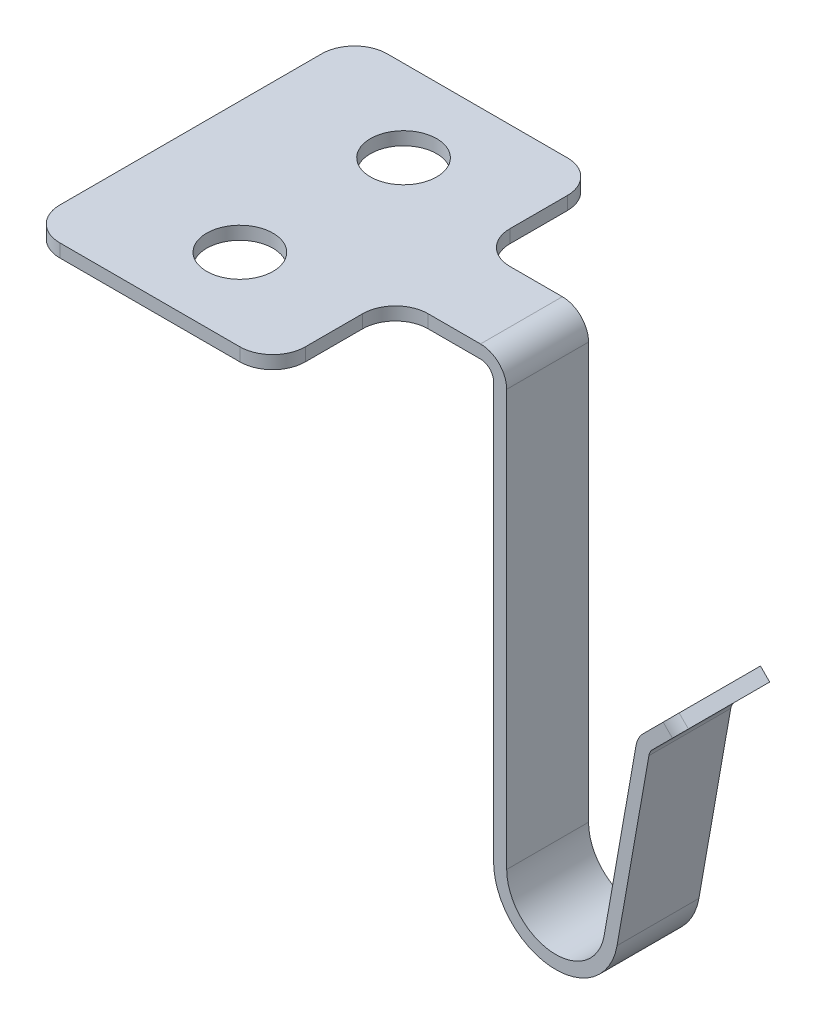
ISO-10303-21;
HEADER;
FILE_DESCRIPTION(('STEP AP214'),'2;1');
FILE_NAME('part.step','',(''),(''),'','','');
FILE_SCHEMA(('AUTOMOTIVE_DESIGN { 1 0 10303 214 1 1 1 1 }'));
ENDSEC;
DATA;
#1=APPLICATION_CONTEXT('core data for automotive mechanical design processes');
#2=APPLICATION_PROTOCOL_DEFINITION('international standard','automotive_design',2000,#1);
#3=PRODUCT_CONTEXT('',#1,'mechanical');
#4=PRODUCT('Part','Part','',(#3));
#5=PRODUCT_RELATED_PRODUCT_CATEGORY('part','',(#4));
#6=PRODUCT_DEFINITION_FORMATION('','',#4);
#7=PRODUCT_DEFINITION_CONTEXT('part definition',#1,'design');
#8=PRODUCT_DEFINITION('design','',#6,#7);
#9=PRODUCT_DEFINITION_SHAPE('','',#8);
#10=(LENGTH_UNIT() NAMED_UNIT(*) SI_UNIT(.MILLI.,.METRE.));
#11=(NAMED_UNIT(*) PLANE_ANGLE_UNIT() SI_UNIT($,.RADIAN.));
#12=(NAMED_UNIT(*) SI_UNIT($,.STERADIAN.) SOLID_ANGLE_UNIT());
#13=UNCERTAINTY_MEASURE_WITH_UNIT(LENGTH_MEASURE(1.E-05),#10,'distance_accuracy_value','');
#14=(GEOMETRIC_REPRESENTATION_CONTEXT(3) GLOBAL_UNCERTAINTY_ASSIGNED_CONTEXT((#13)) GLOBAL_UNIT_ASSIGNED_CONTEXT((#10,
#11,#12)) REPRESENTATION_CONTEXT('',''));
#15=CARTESIAN_POINT('',(0.,0.,0.));
#16=DIRECTION('',(0.,0.,1.));
#17=DIRECTION('',(1.,0.,0.));
#18=AXIS2_PLACEMENT_3D('',#15,#16,#17);
#19=CARTESIAN_POINT('',(25.8554424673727,-5.10318126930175,11.25));
#20=DIRECTION('',(0.353553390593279,0.353553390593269,0.866025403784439));
#21=DIRECTION('',(0.92582009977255,0.,-0.377964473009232));
#22=AXIS2_PLACEMENT_3D('',#19,#20,#21);
#23=PLANE('',#22);
#24=DIRECTION('',(0.707106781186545,-0.70710678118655,0.));
#25=VECTOR('',#24,1.);
#26=CARTESIAN_POINT('',(34.8000000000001,-10.9858766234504,9.99999999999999));
#27=LINE('',#26,#25);
#28=CARTESIAN_POINT('',(34.8000000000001,-10.9858766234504,9.99999999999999));
#29=VERTEX_POINT('',#28);
#30=CARTESIAN_POINT('',(35.3656854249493,-11.5515620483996,10.));
#31=VERTEX_POINT('',#30);
#32=EDGE_CURVE('E229',#29,#31,#27,.T.);
#33=ORIENTED_EDGE('',*,*,#32,.F.);
#34=DIRECTION('',(0.612372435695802,0.612372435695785,-0.500000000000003));
#35=VECTOR('',#34,1.);
#36=CARTESIAN_POINT('',(32.0663072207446,-13.7195694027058,12.2320508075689));
#37=LINE('',#36,#35);
#38=CARTESIAN_POINT('',(32.0663072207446,-13.7195694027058,12.2320508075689));
#39=VERTEX_POINT('',#38);
#40=EDGE_CURVE('E350',#39,#29,#37,.T.);
#41=ORIENTED_EDGE('',*,*,#40,.F.);
#42=DIRECTION('',(0.707106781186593,-0.707106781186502,0.));
#43=VECTOR('',#42,1.);
#44=CARTESIAN_POINT('',(32.0663072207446,-13.7195694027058,12.2320508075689));
#45=LINE('',#44,#43);
#46=CARTESIAN_POINT('',(32.6319926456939,-14.285254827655,12.2320508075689));
#47=VERTEX_POINT('',#46);
#48=EDGE_CURVE('E237',#39,#47,#45,.T.);
#49=ORIENTED_EDGE('',*,*,#48,.T.);
#50=DIRECTION('',(0.612372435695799,0.612372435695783,-0.500000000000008));
#51=VECTOR('',#50,1.);
#52=CARTESIAN_POINT('',(32.6319926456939,-14.285254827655,12.2320508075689));
#53=LINE('',#52,#51);
#54=EDGE_CURVE('E346',#47,#31,#53,.T.);
#55=ORIENTED_EDGE('',*,*,#54,.T.);
#56=EDGE_LOOP('',(#33,#41,#49,#55));
#57=FACE_BOUND('',#56,.T.);
#58=ADVANCED_FACE('F17',(#57),#23,.T.);
#59=CARTESIAN_POINT('',(31.9279228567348,-11.175661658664,8.75));
#60=DIRECTION('',(0.353553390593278,0.353553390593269,-0.866025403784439));
#61=DIRECTION('',(-0.92582009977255,0.,-0.377964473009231));
#62=AXIS2_PLACEMENT_3D('',#59,#60,#61);
#63=PLANE('',#62);
#64=ORIENTED_EDGE('',*,*,#32,.T.);
#65=DIRECTION('',(-0.612372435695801,-0.612372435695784,-0.500000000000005));
#66=VECTOR('',#65,1.);
#67=CARTESIAN_POINT('',(35.3656854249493,-11.5515620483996,10.));
#68=LINE('',#67,#66);
#69=CARTESIAN_POINT('',(32.6319926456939,-14.285254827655,7.76794919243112));
#70=VERTEX_POINT('',#69);
#71=EDGE_CURVE('E344',#31,#70,#68,.T.);
#72=ORIENTED_EDGE('',*,*,#71,.T.);
#73=DIRECTION('',(-0.707106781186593,0.707106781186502,0.));
#74=VECTOR('',#73,1.);
#75=CARTESIAN_POINT('',(32.6319926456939,-14.285254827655,7.76794919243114));
#76=LINE('',#75,#74);
#77=CARTESIAN_POINT('',(32.0663072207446,-13.7195694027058,7.76794919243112));
#78=VERTEX_POINT('',#77);
#79=EDGE_CURVE('E231',#70,#78,#76,.T.);
#80=ORIENTED_EDGE('',*,*,#79,.T.);
#81=DIRECTION('',(-0.612372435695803,-0.612372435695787,-0.499999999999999));
#82=VECTOR('',#81,1.);
#83=CARTESIAN_POINT('',(34.8000000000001,-10.9858766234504,10.));
#84=LINE('',#83,#82);
#85=EDGE_CURVE('E228',#29,#78,#84,.T.);
#86=ORIENTED_EDGE('',*,*,#85,.F.);
#87=EDGE_LOOP('',(#64,#72,#80,#86));
#88=FACE_BOUND('',#87,.T.);
#89=ADVANCED_FACE('F800',(#88),#63,.T.);
#90=CARTESIAN_POINT('',(7.98664621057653,-37.7992304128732,10.));
#91=DIRECTION('',(-0.707106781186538,0.707106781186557,0.));
#92=DIRECTION('',(-0.707106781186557,-0.707106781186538,0.));
#93=AXIS2_PLACEMENT_3D('',#90,#91,#92);
#94=PLANE('',#93);
#95=ORIENTED_EDGE('',*,*,#40,.T.);
#96=ORIENTED_EDGE('',*,*,#85,.T.);
#97=CARTESIAN_POINT('',(31.3592004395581,-14.4266761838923,9.5));
#98=DIRECTION('',(-0.707106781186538,0.707106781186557,0.));
#99=DIRECTION('',(-0.707106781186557,-0.707106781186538,0.));
#100=AXIS2_PLACEMENT_3D('',#97,#98,#99);
#101=CIRCLE('',#100,2.);
#102=CARTESIAN_POINT('',(31.3592004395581,-14.4266761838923,7.5));
#103=VERTEX_POINT('',#102);
#104=EDGE_CURVE('E20',#78,#103,#101,.T.);
#105=ORIENTED_EDGE('',*,*,#104,.T.);
#106=DIRECTION('',(-0.707106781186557,-0.707106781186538,0.));
#107=VECTOR('',#106,1.);
#108=CARTESIAN_POINT('',(7.98664621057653,-37.7992304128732,7.5));
#109=LINE('',#108,#107);
#110=CARTESIAN_POINT('',(30.1425964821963,-15.643280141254,7.5));
#111=VERTEX_POINT('',#110);
#112=EDGE_CURVE('E207',#103,#111,#109,.T.);
#113=ORIENTED_EDGE('',*,*,#112,.T.);
#114=DIRECTION('',(0.,0.,-1.));
#115=VECTOR('',#114,1.);
#116=CARTESIAN_POINT('',(30.1425964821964,-15.643280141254,10.));
#117=LINE('',#116,#115);
#118=CARTESIAN_POINT('',(30.1425964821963,-15.643280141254,12.5));
#119=VERTEX_POINT('',#118);
#120=EDGE_CURVE('E338',#119,#111,#117,.T.);
#121=ORIENTED_EDGE('',*,*,#120,.F.);
#122=DIRECTION('',(-0.707106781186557,-0.707106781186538,0.));
#123=VECTOR('',#122,1.);
#124=CARTESIAN_POINT('',(7.98664621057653,-37.7992304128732,12.5));
#125=LINE('',#124,#123);
#126=CARTESIAN_POINT('',(31.3592004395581,-14.4266761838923,12.5));
#127=VERTEX_POINT('',#126);
#128=EDGE_CURVE('E216',#119,#127,#125,.F.);
#129=ORIENTED_EDGE('',*,*,#128,.T.);
#130=CARTESIAN_POINT('',(31.3592004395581,-14.4266761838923,10.5));
#131=DIRECTION('',(0.707106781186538,-0.707106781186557,0.));
#132=DIRECTION('',(0.707106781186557,0.707106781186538,0.));
#133=AXIS2_PLACEMENT_3D('',#130,#131,#132);
#134=CIRCLE('',#133,2.);
#135=EDGE_CURVE('E348',#127,#39,#134,.F.);
#136=ORIENTED_EDGE('',*,*,#135,.T.);
#137=EDGE_LOOP('',(#95,#96,#105,#113,#121,#129,#136));
#138=FACE_BOUND('',#137,.T.);
#139=ADVANCED_FACE('F226',(#138),#94,.T.);
#140=CARTESIAN_POINT('',(8.55233163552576,-38.3649158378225,10.));
#141=DIRECTION('',(-0.707106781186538,0.707106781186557,0.));
#142=DIRECTION('',(-0.707106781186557,-0.707106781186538,0.));
#143=AXIS2_PLACEMENT_3D('',#140,#141,#142);
#144=PLANE('',#143);
#145=ORIENTED_EDGE('',*,*,#71,.F.);
#146=ORIENTED_EDGE('',*,*,#54,.F.);
#147=CARTESIAN_POINT('',(31.9248858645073,-14.9923616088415,10.5));
#148=DIRECTION('',(0.707106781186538,-0.707106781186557,0.));
#149=DIRECTION('',(0.707106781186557,0.707106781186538,0.));
#150=AXIS2_PLACEMENT_3D('',#147,#148,#149);
#151=CIRCLE('',#150,2.);
#152=CARTESIAN_POINT('',(31.9248858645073,-14.9923616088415,12.5));
#153=VERTEX_POINT('',#152);
#154=EDGE_CURVE('E345',#153,#47,#151,.F.);
#155=ORIENTED_EDGE('',*,*,#154,.F.);
#156=DIRECTION('',(-0.707106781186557,-0.707106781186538,0.));
#157=VECTOR('',#156,1.);
#158=CARTESIAN_POINT('',(8.55233163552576,-38.3649158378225,12.5));
#159=LINE('',#158,#157);
#160=CARTESIAN_POINT('',(30.7082819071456,-16.2089655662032,12.5));
#161=VERTEX_POINT('',#160);
#162=EDGE_CURVE('E347',#161,#153,#159,.F.);
#163=ORIENTED_EDGE('',*,*,#162,.F.);
#164=DIRECTION('',(0.,0.,-1.));
#165=VECTOR('',#164,1.);
#166=CARTESIAN_POINT('',(30.7082819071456,-16.2089655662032,10.));
#167=LINE('',#166,#165);
#168=CARTESIAN_POINT('',(30.7082819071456,-16.2089655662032,7.5));
#169=VERTEX_POINT('',#168);
#170=EDGE_CURVE('E335',#161,#169,#167,.T.);
#171=ORIENTED_EDGE('',*,*,#170,.T.);
#172=DIRECTION('',(-0.707106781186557,-0.707106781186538,0.));
#173=VECTOR('',#172,1.);
#174=CARTESIAN_POINT('',(8.55233163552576,-38.3649158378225,7.5));
#175=LINE('',#174,#173);
#176=CARTESIAN_POINT('',(31.9248858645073,-14.9923616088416,7.5));
#177=VERTEX_POINT('',#176);
#178=EDGE_CURVE('E386',#177,#169,#175,.T.);
#179=ORIENTED_EDGE('',*,*,#178,.F.);
#180=CARTESIAN_POINT('',(31.9248858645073,-14.9923616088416,9.5));
#181=DIRECTION('',(-0.707106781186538,0.707106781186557,0.));
#182=DIRECTION('',(-0.707106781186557,-0.707106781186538,0.));
#183=AXIS2_PLACEMENT_3D('',#180,#181,#182);
#184=CIRCLE('',#183,2.);
#185=EDGE_CURVE('E220',#70,#177,#184,.T.);
#186=ORIENTED_EDGE('',*,*,#185,.F.);
#187=EDGE_LOOP('',(#145,#146,#155,#163,#171,#179,#186));
#188=FACE_BOUND('',#187,.T.);
#189=ADVANCED_FACE('F373',(#188),#144,.F.);
#190=CARTESIAN_POINT('',(31.2739673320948,-16.7746509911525,10.));
#191=DIRECTION('',(0.,0.,-1.));
#192=DIRECTION('',(-1.,0.,0.));
#193=AXIS2_PLACEMENT_3D('',#190,#191,#192);
#194=CYLINDRICAL_SURFACE('',#193,1.6);
#195=CARTESIAN_POINT('',(31.2739673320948,-16.7746509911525,12.5));
#196=DIRECTION('',(0.,0.,-1.));
#197=DIRECTION('',(-1.,0.,0.));
#198=AXIS2_PLACEMENT_3D('',#195,#196,#197);
#199=CIRCLE('',#198,1.6);
#200=CARTESIAN_POINT('',(29.6982749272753,-16.4968139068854,12.5));
#201=VERTEX_POINT('',#200);
#202=EDGE_CURVE('E339',#201,#119,#199,.T.);
#203=ORIENTED_EDGE('',*,*,#202,.T.);
#204=ORIENTED_EDGE('',*,*,#120,.T.);
#205=CARTESIAN_POINT('',(31.2739673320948,-16.7746509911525,7.5));
#206=DIRECTION('',(0.,0.,-1.));
#207=DIRECTION('',(-1.,0.,0.));
#208=AXIS2_PLACEMENT_3D('',#205,#206,#207);
#209=CIRCLE('',#208,1.6);
#210=CARTESIAN_POINT('',(29.6982749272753,-16.4968139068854,7.5));
#211=VERTEX_POINT('',#210);
#212=EDGE_CURVE('E212',#111,#211,#209,.F.);
#213=ORIENTED_EDGE('',*,*,#212,.T.);
#214=DIRECTION('',(0.,0.,1.));
#215=VECTOR('',#214,1.);
#216=CARTESIAN_POINT('',(29.6982749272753,-16.4968139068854,10.));
#217=LINE('',#216,#215);
#218=EDGE_CURVE('E330',#201,#211,#217,.F.);
#219=ORIENTED_EDGE('',*,*,#218,.F.);
#220=EDGE_LOOP('',(#203,#204,#213,#219));
#221=FACE_BOUND('',#220,.T.);
#222=ADVANCED_FACE('F358',(#221),#194,.T.);
#223=CARTESIAN_POINT('',(31.2739673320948,-16.7746509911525,10.));
#224=DIRECTION('',(0.,0.,-1.));
#225=DIRECTION('',(-1.,0.,0.));
#226=AXIS2_PLACEMENT_3D('',#223,#224,#225);
#227=CYLINDRICAL_SURFACE('',#226,0.799999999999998);
#228=ORIENTED_EDGE('',*,*,#170,.F.);
#229=CARTESIAN_POINT('',(31.2739673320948,-16.7746509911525,12.5));
#230=DIRECTION('',(0.,0.,-1.));
#231=DIRECTION('',(-1.,0.,0.));
#232=AXIS2_PLACEMENT_3D('',#229,#230,#231);
#233=CIRCLE('',#232,0.799999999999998);
#234=CARTESIAN_POINT('',(30.4861211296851,-16.6357324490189,12.5));
#235=VERTEX_POINT('',#234);
#236=EDGE_CURVE('E336',#235,#161,#233,.T.);
#237=ORIENTED_EDGE('',*,*,#236,.F.);
#238=DIRECTION('',(0.,0.,1.));
#239=VECTOR('',#238,1.);
#240=CARTESIAN_POINT('',(30.4861211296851,-16.6357324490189,10.));
#241=LINE('',#240,#239);
#242=CARTESIAN_POINT('',(30.4861211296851,-16.6357324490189,7.5));
#243=VERTEX_POINT('',#242);
#244=EDGE_CURVE('E397',#235,#243,#241,.F.);
#245=ORIENTED_EDGE('',*,*,#244,.T.);
#246=CARTESIAN_POINT('',(31.2739673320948,-16.7746509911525,7.5));
#247=DIRECTION('',(0.,0.,-1.));
#248=DIRECTION('',(-1.,0.,0.));
#249=AXIS2_PLACEMENT_3D('',#246,#247,#248);
#250=CIRCLE('',#249,0.799999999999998);
#251=EDGE_CURVE('E333',#169,#243,#250,.F.);
#252=ORIENTED_EDGE('',*,*,#251,.F.);
#253=EDGE_LOOP('',(#228,#237,#245,#252));
#254=FACE_BOUND('',#253,.T.);
#255=ADVANCED_FACE('F395',(#254),#227,.F.);
#256=CARTESIAN_POINT('',(20.2,-1.6,10.));
#257=DIRECTION('',(0.,0.,-1.));
#258=DIRECTION('',(-1.,0.,0.));
#259=AXIS2_PLACEMENT_3D('',#256,#257,#258);
#260=CYLINDRICAL_SURFACE('',#259,0.799999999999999);
#261=DIRECTION('',(0.,0.,1.));
#262=VECTOR('',#261,1.);
#263=CARTESIAN_POINT('',(21.,-1.6,10.));
#264=LINE('',#263,#262);
#265=CARTESIAN_POINT('',(21.,-1.6,7.5));
#266=VERTEX_POINT('',#265);
#267=CARTESIAN_POINT('',(21.,-1.6,12.5));
#268=VERTEX_POINT('',#267);
#269=EDGE_CURVE('E444',#266,#268,#264,.T.);
#270=ORIENTED_EDGE('',*,*,#269,.T.);
#271=CARTESIAN_POINT('',(20.2,-1.6,12.5));
#272=DIRECTION('',(0.,0.,-1.));
#273=DIRECTION('',(-1.,0.,0.));
#274=AXIS2_PLACEMENT_3D('',#271,#272,#273);
#275=CIRCLE('',#274,0.799999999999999);
#276=CARTESIAN_POINT('',(20.2,-0.800000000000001,12.5));
#277=VERTEX_POINT('',#276);
#278=EDGE_CURVE('E331',#277,#268,#275,.T.);
#279=ORIENTED_EDGE('',*,*,#278,.F.);
#280=DIRECTION('',(0.,0.,1.));
#281=VECTOR('',#280,1.);
#282=CARTESIAN_POINT('',(20.2,-0.8,10.));
#283=LINE('',#282,#281);
#284=CARTESIAN_POINT('',(20.2,-0.8,7.5));
#285=VERTEX_POINT('',#284);
#286=EDGE_CURVE('E327',#277,#285,#283,.F.);
#287=ORIENTED_EDGE('',*,*,#286,.T.);
#288=CARTESIAN_POINT('',(20.2,-1.6,7.5));
#289=DIRECTION('',(0.,0.,-1.));
#290=DIRECTION('',(-1.,0.,0.));
#291=AXIS2_PLACEMENT_3D('',#288,#289,#290);
#292=CIRCLE('',#291,0.799999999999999);
#293=EDGE_CURVE('E328',#266,#285,#292,.F.);
#294=ORIENTED_EDGE('',*,*,#293,.F.);
#295=EDGE_LOOP('',(#270,#279,#287,#294));
#296=FACE_BOUND('',#295,.T.);
#297=ADVANCED_FACE('F535',(#296),#260,.F.);
#298=CARTESIAN_POINT('',(19.9559180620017,-3.02339380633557,10.5));
#299=DIRECTION('',(0.707106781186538,-0.707106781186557,0.));
#300=DIRECTION('',(0.707106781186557,0.707106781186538,0.));
#301=AXIS2_PLACEMENT_3D('',#298,#299,#300);
#302=CYLINDRICAL_SURFACE('',#301,2.);
#303=ORIENTED_EDGE('',*,*,#135,.F.);
#304=DIRECTION('',(0.707106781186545,-0.70710678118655,0.));
#305=VECTOR('',#304,1.);
#306=CARTESIAN_POINT('',(31.3592004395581,-14.4266761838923,12.5));
#307=LINE('',#306,#305);
#308=EDGE_CURVE('E244',#127,#153,#307,.T.);
#309=ORIENTED_EDGE('',*,*,#308,.T.);
#310=ORIENTED_EDGE('',*,*,#154,.T.);
#311=ORIENTED_EDGE('',*,*,#48,.F.);
#312=EDGE_LOOP('',(#303,#309,#310,#311));
#313=FACE_BOUND('',#312,.T.);
#314=ADVANCED_FACE('F370',(#313),#302,.T.);
#315=CARTESIAN_POINT('',(24.3795131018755,-46.6610111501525,10.));
#316=DIRECTION('',(-0.984807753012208,0.173648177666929,0.));
#317=DIRECTION('',(-0.173648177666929,-0.984807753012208,0.));
#318=AXIS2_PLACEMENT_3D('',#315,#316,#317);
#319=PLANE('',#318);
#320=DIRECTION('',(0.173648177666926,0.984807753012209,0.));
#321=VECTOR('',#320,1.);
#322=CARTESIAN_POINT('',(27.7544232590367,-27.5209445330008,12.5));
#323=LINE('',#322,#321);
#324=CARTESIAN_POINT('',(27.7544232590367,-27.5209445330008,12.5));
#325=VERTEX_POINT('',#324);
#326=EDGE_CURVE('E247',#325,#201,#323,.T.);
#327=ORIENTED_EDGE('',*,*,#326,.T.);
#328=ORIENTED_EDGE('',*,*,#218,.T.);
#329=DIRECTION('',(-0.173648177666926,-0.984807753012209,0.));
#330=VECTOR('',#329,1.);
#331=CARTESIAN_POINT('',(29.6982749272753,-16.4968139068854,7.5));
#332=LINE('',#331,#330);
#333=CARTESIAN_POINT('',(27.7544232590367,-27.5209445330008,7.5));
#334=VERTEX_POINT('',#333);
#335=EDGE_CURVE('E306',#211,#334,#332,.T.);
#336=ORIENTED_EDGE('',*,*,#335,.T.);
#337=DIRECTION('',(0.,0.,1.));
#338=VECTOR('',#337,1.);
#339=CARTESIAN_POINT('',(27.7544232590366,-27.5209445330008,10.));
#340=LINE('',#339,#338);
#341=EDGE_CURVE('E454',#334,#325,#340,.T.);
#342=ORIENTED_EDGE('',*,*,#341,.T.);
#343=EDGE_LOOP('',(#327,#328,#336,#342));
#344=FACE_BOUND('',#343,.T.);
#345=ADVANCED_FACE('F526',(#344),#319,.T.);
#346=CARTESIAN_POINT('',(24.8,-27.,10.));
#347=DIRECTION('',(0.,0.,1.));
#348=DIRECTION('',(1.,0.,0.));
#349=AXIS2_PLACEMENT_3D('',#346,#347,#348);
#350=CYLINDRICAL_SURFACE('',#349,3.);
#351=DIRECTION('',(0.,0.,1.));
#352=VECTOR('',#351,1.);
#353=CARTESIAN_POINT('',(21.8,-27.,10.));
#354=LINE('',#353,#352);
#355=CARTESIAN_POINT('',(21.8,-27.,12.5));
#356=VERTEX_POINT('',#355);
#357=CARTESIAN_POINT('',(21.8,-27.,7.5));
#358=VERTEX_POINT('',#357);
#359=EDGE_CURVE('E447',#356,#358,#354,.F.);
#360=ORIENTED_EDGE('',*,*,#359,.F.);
#361=CARTESIAN_POINT('',(24.8,-27.,12.5));
#362=DIRECTION('',(0.,0.,1.));
#363=DIRECTION('',(1.,0.,0.));
#364=AXIS2_PLACEMENT_3D('',#361,#362,#363);
#365=CIRCLE('',#364,3.);
#366=EDGE_CURVE('E310',#356,#325,#365,.T.);
#367=ORIENTED_EDGE('',*,*,#366,.T.);
#368=ORIENTED_EDGE('',*,*,#341,.F.);
#369=CARTESIAN_POINT('',(24.8,-27.,7.5));
#370=DIRECTION('',(0.,0.,1.));
#371=DIRECTION('',(1.,0.,0.));
#372=AXIS2_PLACEMENT_3D('',#369,#370,#371);
#373=CIRCLE('',#372,3.);
#374=EDGE_CURVE('E304',#334,#358,#373,.F.);
#375=ORIENTED_EDGE('',*,*,#374,.T.);
#376=EDGE_LOOP('',(#360,#367,#368,#375));
#377=FACE_BOUND('',#376,.T.);
#378=ADVANCED_FACE('F523',(#377),#350,.F.);
#379=CARTESIAN_POINT('',(21.8,-17.5102512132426,10.));
#380=DIRECTION('',(1.,0.,0.));
#381=DIRECTION('',(0.,1.,0.));
#382=AXIS2_PLACEMENT_3D('',#379,#380,#381);
#383=PLANE('',#382);
#384=DIRECTION('',(0.,1.,0.));
#385=VECTOR('',#384,1.);
#386=CARTESIAN_POINT('',(21.8,0.,12.5));
#387=LINE('',#386,#385);
#388=CARTESIAN_POINT('',(21.8,-1.6,12.5));
#389=VERTEX_POINT('',#388);
#390=EDGE_CURVE('E313',#389,#356,#387,.F.);
#391=ORIENTED_EDGE('',*,*,#390,.T.);
#392=ORIENTED_EDGE('',*,*,#359,.T.);
#393=DIRECTION('',(0.,1.,0.));
#394=VECTOR('',#393,1.);
#395=CARTESIAN_POINT('',(21.8,0.,7.5));
#396=LINE('',#395,#394);
#397=CARTESIAN_POINT('',(21.8,-1.6,7.5));
#398=VERTEX_POINT('',#397);
#399=EDGE_CURVE('E303',#358,#398,#396,.T.);
#400=ORIENTED_EDGE('',*,*,#399,.T.);
#401=DIRECTION('',(0.,0.,-1.));
#402=VECTOR('',#401,1.);
#403=CARTESIAN_POINT('',(21.8,-1.6,10.));
#404=LINE('',#403,#402);
#405=EDGE_CURVE('E309',#389,#398,#404,.T.);
#406=ORIENTED_EDGE('',*,*,#405,.F.);
#407=EDGE_LOOP('',(#391,#392,#400,#406));
#408=FACE_BOUND('',#407,.T.);
#409=ADVANCED_FACE('F521',(#408),#383,.T.);
#410=CARTESIAN_POINT('',(21.,-17.5102512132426,10.));
#411=DIRECTION('',(1.,0.,0.));
#412=DIRECTION('',(0.,1.,0.));
#413=AXIS2_PLACEMENT_3D('',#410,#411,#412);
#414=PLANE('',#413);
#415=DIRECTION('',(0.,0.,1.));
#416=VECTOR('',#415,1.);
#417=CARTESIAN_POINT('',(21.,-27.,10.));
#418=LINE('',#417,#416);
#419=CARTESIAN_POINT('',(21.,-27.,12.5));
#420=VERTEX_POINT('',#419);
#421=CARTESIAN_POINT('',(21.,-27.,7.5));
#422=VERTEX_POINT('',#421);
#423=EDGE_CURVE('E440',#420,#422,#418,.F.);
#424=ORIENTED_EDGE('',*,*,#423,.F.);
#425=DIRECTION('',(0.,1.,0.));
#426=VECTOR('',#425,1.);
#427=CARTESIAN_POINT('',(21.,0.,12.5));
#428=LINE('',#427,#426);
#429=EDGE_CURVE('E317',#420,#268,#428,.T.);
#430=ORIENTED_EDGE('',*,*,#429,.T.);
#431=ORIENTED_EDGE('',*,*,#269,.F.);
#432=DIRECTION('',(0.,1.,0.));
#433=VECTOR('',#432,1.);
#434=CARTESIAN_POINT('',(21.,0.,7.5));
#435=LINE('',#434,#433);
#436=EDGE_CURVE('E299',#266,#422,#435,.F.);
#437=ORIENTED_EDGE('',*,*,#436,.T.);
#438=EDGE_LOOP('',(#424,#430,#431,#437));
#439=FACE_BOUND('',#438,.T.);
#440=ADVANCED_FACE('F601',(#439),#414,.F.);
#441=CARTESIAN_POINT('',(24.8,-27.,10.));
#442=DIRECTION('',(0.,0.,1.));
#443=DIRECTION('',(1.,0.,0.));
#444=AXIS2_PLACEMENT_3D('',#441,#442,#443);
#445=CYLINDRICAL_SURFACE('',#444,3.8);
#446=CARTESIAN_POINT('',(24.8,-27.,12.5));
#447=DIRECTION('',(0.,0.,1.));
#448=DIRECTION('',(1.,0.,0.));
#449=AXIS2_PLACEMENT_3D('',#446,#447,#448);
#450=CIRCLE('',#449,3.8);
#451=CARTESIAN_POINT('',(28.5422694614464,-27.6598630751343,12.5));
#452=VERTEX_POINT('',#451);
#453=EDGE_CURVE('E314',#452,#420,#450,.F.);
#454=ORIENTED_EDGE('',*,*,#453,.T.);
#455=ORIENTED_EDGE('',*,*,#423,.T.);
#456=CARTESIAN_POINT('',(24.8,-27.,7.5));
#457=DIRECTION('',(0.,0.,1.));
#458=DIRECTION('',(1.,0.,0.));
#459=AXIS2_PLACEMENT_3D('',#456,#457,#458);
#460=CIRCLE('',#459,3.8);
#461=CARTESIAN_POINT('',(28.5422694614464,-27.6598630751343,7.5));
#462=VERTEX_POINT('',#461);
#463=EDGE_CURVE('E297',#422,#462,#460,.T.);
#464=ORIENTED_EDGE('',*,*,#463,.T.);
#465=DIRECTION('',(0.,0.,1.));
#466=VECTOR('',#465,1.);
#467=CARTESIAN_POINT('',(28.5422694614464,-27.6598630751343,10.));
#468=LINE('',#467,#466);
#469=EDGE_CURVE('E402',#462,#452,#468,.T.);
#470=ORIENTED_EDGE('',*,*,#469,.T.);
#471=EDGE_LOOP('',(#454,#455,#464,#470));
#472=FACE_BOUND('',#471,.T.);
#473=ADVANCED_FACE('F598',(#472),#445,.T.);
#474=CARTESIAN_POINT('',(25.1673593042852,-46.7999296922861,10.));
#475=DIRECTION('',(-0.984807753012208,0.173648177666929,0.));
#476=DIRECTION('',(-0.173648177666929,-0.984807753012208,0.));
#477=AXIS2_PLACEMENT_3D('',#474,#475,#476);
#478=PLANE('',#477);
#479=ORIENTED_EDGE('',*,*,#244,.F.);
#480=DIRECTION('',(-0.173648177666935,-0.984807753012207,0.));
#481=VECTOR('',#480,1.);
#482=CARTESIAN_POINT('',(30.4861211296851,-16.6357324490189,12.5));
#483=LINE('',#482,#481);
#484=EDGE_CURVE('E318',#235,#452,#483,.T.);
#485=ORIENTED_EDGE('',*,*,#484,.T.);
#486=ORIENTED_EDGE('',*,*,#469,.F.);
#487=DIRECTION('',(0.173648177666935,0.984807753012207,0.));
#488=VECTOR('',#487,1.);
#489=CARTESIAN_POINT('',(28.5422694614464,-27.6598630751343,7.5));
#490=LINE('',#489,#488);
#491=EDGE_CURVE('E222',#462,#243,#490,.T.);
#492=ORIENTED_EDGE('',*,*,#491,.T.);
#493=EDGE_LOOP('',(#479,#485,#486,#492));
#494=FACE_BOUND('',#493,.T.);
#495=ADVANCED_FACE('F405',(#494),#478,.F.);
#496=CARTESIAN_POINT('',(29.0646386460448,-12.132114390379,9.5));
#497=DIRECTION('',(-0.707106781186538,0.707106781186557,0.));
#498=DIRECTION('',(-0.707106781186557,-0.707106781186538,0.));
#499=AXIS2_PLACEMENT_3D('',#496,#497,#498);
#500=CYLINDRICAL_SURFACE('',#499,2.);
#501=ORIENTED_EDGE('',*,*,#104,.F.);
#502=ORIENTED_EDGE('',*,*,#79,.F.);
#503=ORIENTED_EDGE('',*,*,#185,.T.);
#504=DIRECTION('',(-0.707106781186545,0.70710678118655,0.));
#505=VECTOR('',#504,1.);
#506=CARTESIAN_POINT('',(31.9248858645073,-14.9923616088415,7.5));
#507=LINE('',#506,#505);
#508=EDGE_CURVE('E209',#177,#103,#507,.T.);
#509=ORIENTED_EDGE('',*,*,#508,.T.);
#510=EDGE_LOOP('',(#501,#502,#503,#509));
#511=FACE_BOUND('',#510,.T.);
#512=ADVANCED_FACE('F218',(#511),#500,.T.);
#513=CARTESIAN_POINT('',(37.9198085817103,-0.800000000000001,10.));
#514=DIRECTION('',(0.,1.,0.));
#515=DIRECTION('',(-1.,0.,0.));
#516=AXIS2_PLACEMENT_3D('',#513,#514,#515);
#517=PLANE('',#516);
#518=CARTESIAN_POINT('',(8.,-0.8,5.));
#519=DIRECTION('',(0.,1.,0.));
#520=DIRECTION('',(-1.,0.,0.));
#521=AXIS2_PLACEMENT_3D('',#518,#519,#520);
#522=CIRCLE('',#521,2.025);
#523=CARTESIAN_POINT('',(5.975,-0.8,5.));
#524=VERTEX_POINT('',#523);
#525=EDGE_CURVE('E276',#524,#524,#522,.T.);
#526=ORIENTED_EDGE('',*,*,#525,.T.);
#527=EDGE_LOOP('',(#526));
#528=FACE_BOUND('',#527,.T.);
#529=CARTESIAN_POINT('',(8.,-0.8,15.));
#530=DIRECTION('',(0.,1.,0.));
#531=DIRECTION('',(-1.,0.,0.));
#532=AXIS2_PLACEMENT_3D('',#529,#530,#531);
#533=CIRCLE('',#532,2.025);
#534=CARTESIAN_POINT('',(5.975,-0.8,15.));
#535=VERTEX_POINT('',#534);
#536=EDGE_CURVE('E279',#535,#535,#533,.T.);
#537=ORIENTED_EDGE('',*,*,#536,.T.);
#538=EDGE_LOOP('',(#537));
#539=FACE_BOUND('',#538,.T.);
#540=DIRECTION('',(1.,0.,0.));
#541=VECTOR('',#540,1.);
#542=CARTESIAN_POINT('',(20.2,-0.8,20.));
#543=LINE('',#542,#541);
#544=CARTESIAN_POINT('',(2.,-0.8,20.));
#545=VERTEX_POINT('',#544);
#546=CARTESIAN_POINT('',(13.,-0.8,20.));
#547=VERTEX_POINT('',#546);
#548=EDGE_CURVE('E282',#545,#547,#543,.T.);
#549=ORIENTED_EDGE('',*,*,#548,.F.);
#550=CARTESIAN_POINT('',(2.,-0.8,18.));
#551=DIRECTION('',(0.,1.,0.));
#552=DIRECTION('',(0.,0.,1.));
#553=AXIS2_PLACEMENT_3D('',#550,#551,#552);
#554=CIRCLE('',#553,2.);
#555=CARTESIAN_POINT('',(0.,-0.8,18.));
#556=VERTEX_POINT('',#555);
#557=EDGE_CURVE('E283',#556,#545,#554,.T.);
#558=ORIENTED_EDGE('',*,*,#557,.F.);
#559=DIRECTION('',(0.,0.,1.));
#560=VECTOR('',#559,1.);
#561=CARTESIAN_POINT('',(0.,-0.8,20.));
#562=LINE('',#561,#560);
#563=CARTESIAN_POINT('',(0.,-0.8,2.));
#564=VERTEX_POINT('',#563);
#565=EDGE_CURVE('E433',#564,#556,#562,.T.);
#566=ORIENTED_EDGE('',*,*,#565,.F.);
#567=CARTESIAN_POINT('',(2.,-0.8,2.));
#568=DIRECTION('',(0.,1.,0.));
#569=DIRECTION('',(0.,0.,1.));
#570=AXIS2_PLACEMENT_3D('',#567,#568,#569);
#571=CIRCLE('',#570,2.);
#572=CARTESIAN_POINT('',(2.,-0.8,0.));
#573=VERTEX_POINT('',#572);
#574=EDGE_CURVE('E287',#573,#564,#571,.T.);
#575=ORIENTED_EDGE('',*,*,#574,.F.);
#576=DIRECTION('',(-1.,0.,0.));
#577=VECTOR('',#576,1.);
#578=CARTESIAN_POINT('',(69.2530539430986,-0.8,0.));
#579=LINE('',#578,#577);
#580=CARTESIAN_POINT('',(13.,-0.8,0.));
#581=VERTEX_POINT('',#580);
#582=EDGE_CURVE('E435',#581,#573,#579,.T.);
#583=ORIENTED_EDGE('',*,*,#582,.F.);
#584=CARTESIAN_POINT('',(13.,-0.8,2.));
#585=DIRECTION('',(0.,-1.,0.));
#586=DIRECTION('',(1.,0.,0.));
#587=AXIS2_PLACEMENT_3D('',#584,#585,#586);
#588=CIRCLE('',#587,2.);
#589=CARTESIAN_POINT('',(15.,-0.8,2.));
#590=VERTEX_POINT('',#589);
#591=EDGE_CURVE('E291',#590,#581,#588,.F.);
#592=ORIENTED_EDGE('',*,*,#591,.F.);
#593=DIRECTION('',(0.,0.,1.));
#594=VECTOR('',#593,1.);
#595=CARTESIAN_POINT('',(15.,-0.8,7.5));
#596=LINE('',#595,#594);
#597=CARTESIAN_POINT('',(15.,-0.8,5.5));
#598=VERTEX_POINT('',#597);
#599=EDGE_CURVE('E438',#590,#598,#596,.T.);
#600=ORIENTED_EDGE('',*,*,#599,.T.);
#601=CARTESIAN_POINT('',(17.,-0.8,5.5));
#602=DIRECTION('',(0.,-1.,0.));
#603=DIRECTION('',(1.,0.,0.));
#604=AXIS2_PLACEMENT_3D('',#601,#602,#603);
#605=CIRCLE('',#604,2.);
#606=CARTESIAN_POINT('',(17.,-0.8,7.5));
#607=VERTEX_POINT('',#606);
#608=EDGE_CURVE('E221',#598,#607,#605,.F.);
#609=ORIENTED_EDGE('',*,*,#608,.T.);
#610=DIRECTION('',(1.,0.,0.));
#611=VECTOR('',#610,1.);
#612=CARTESIAN_POINT('',(39.2899215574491,-0.8,7.5));
#613=LINE('',#612,#611);
#614=EDGE_CURVE('E302',#607,#285,#613,.T.);
#615=ORIENTED_EDGE('',*,*,#614,.T.);
#616=ORIENTED_EDGE('',*,*,#286,.F.);
#617=DIRECTION('',(-1.,0.,0.));
#618=VECTOR('',#617,1.);
#619=CARTESIAN_POINT('',(15.,-0.800000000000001,12.5));
#620=LINE('',#619,#618);
#621=CARTESIAN_POINT('',(17.,-0.800000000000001,12.5));
#622=VERTEX_POINT('',#621);
#623=EDGE_CURVE('E423',#277,#622,#620,.T.);
#624=ORIENTED_EDGE('',*,*,#623,.T.);
#625=CARTESIAN_POINT('',(17.,-0.8,14.5));
#626=DIRECTION('',(0.,-1.,0.));
#627=DIRECTION('',(1.,0.,0.));
#628=AXIS2_PLACEMENT_3D('',#625,#626,#627);
#629=CIRCLE('',#628,2.);
#630=CARTESIAN_POINT('',(15.,-0.8,14.5));
#631=VERTEX_POINT('',#630);
#632=EDGE_CURVE('E319',#622,#631,#629,.F.);
#633=ORIENTED_EDGE('',*,*,#632,.T.);
#634=DIRECTION('',(0.,0.,1.));
#635=VECTOR('',#634,1.);
#636=CARTESIAN_POINT('',(15.,-0.8,20.));
#637=LINE('',#636,#635);
#638=CARTESIAN_POINT('',(15.,-0.8,18.));
#639=VERTEX_POINT('',#638);
#640=EDGE_CURVE('E326',#631,#639,#637,.T.);
#641=ORIENTED_EDGE('',*,*,#640,.T.);
#642=CARTESIAN_POINT('',(13.,-0.8,18.));
#643=DIRECTION('',(0.,1.,0.));
#644=DIRECTION('',(-1.,0.,0.));
#645=AXIS2_PLACEMENT_3D('',#642,#643,#644);
#646=CIRCLE('',#645,2.);
#647=EDGE_CURVE('E323',#547,#639,#646,.T.);
#648=ORIENTED_EDGE('',*,*,#647,.F.);
#649=EDGE_LOOP('',(#549,#558,#566,#575,#583,#592,#600,#609,#615,#616,#624,#633,#641,#648));
#650=FACE_BOUND('',#649,.T.);
#651=ADVANCED_FACE('F460',(#528,#539,#650),#517,.F.);
#652=CARTESIAN_POINT('',(13.,-0.4,18.));
#653=DIRECTION('',(0.,1.,0.));
#654=DIRECTION('',(-1.,0.,0.));
#655=AXIS2_PLACEMENT_3D('',#652,#653,#654);
#656=CYLINDRICAL_SURFACE('',#655,2.);
#657=ORIENTED_EDGE('',*,*,#647,.T.);
#658=DIRECTION('',(0.,-1.,0.));
#659=VECTOR('',#658,1.);
#660=CARTESIAN_POINT('',(15.,0.,18.));
#661=LINE('',#660,#659);
#662=CARTESIAN_POINT('',(15.,0.,18.));
#663=VERTEX_POINT('',#662);
#664=EDGE_CURVE('E322',#639,#663,#661,.F.);
#665=ORIENTED_EDGE('',*,*,#664,.T.);
#666=CARTESIAN_POINT('',(13.,0.,18.));
#667=DIRECTION('',(0.,1.,0.));
#668=DIRECTION('',(-1.,0.,0.));
#669=AXIS2_PLACEMENT_3D('',#666,#667,#668);
#670=CIRCLE('',#669,2.);
#671=CARTESIAN_POINT('',(13.,0.,20.));
#672=VERTEX_POINT('',#671);
#673=EDGE_CURVE('E273',#672,#663,#670,.T.);
#674=ORIENTED_EDGE('',*,*,#673,.F.);
#675=DIRECTION('',(0.,1.,0.));
#676=VECTOR('',#675,1.);
#677=CARTESIAN_POINT('',(13.,-0.8,20.));
#678=LINE('',#677,#676);
#679=EDGE_CURVE('E285',#547,#672,#678,.T.);
#680=ORIENTED_EDGE('',*,*,#679,.F.);
#681=EDGE_LOOP('',(#657,#665,#674,#680));
#682=FACE_BOUND('',#681,.T.);
#683=ADVANCED_FACE('F467',(#682),#656,.T.);
#684=CARTESIAN_POINT('',(15.,0.,20.));
#685=DIRECTION('',(-1.,0.,0.));
#686=DIRECTION('',(0.,-1.,0.));
#687=AXIS2_PLACEMENT_3D('',#684,#685,#686);
#688=PLANE('',#687);
#689=DIRECTION('',(0.,0.,1.));
#690=VECTOR('',#689,1.);
#691=CARTESIAN_POINT('',(15.,0.,10.));
#692=LINE('',#691,#690);
#693=CARTESIAN_POINT('',(15.,0.,14.5));
#694=VERTEX_POINT('',#693);
#695=EDGE_CURVE('E272',#663,#694,#692,.F.);
#696=ORIENTED_EDGE('',*,*,#695,.F.);
#697=ORIENTED_EDGE('',*,*,#664,.F.);
#698=ORIENTED_EDGE('',*,*,#640,.F.);
#699=DIRECTION('',(0.,-1.,0.));
#700=VECTOR('',#699,1.);
#701=CARTESIAN_POINT('',(15.,0.,14.5));
#702=LINE('',#701,#700);
#703=EDGE_CURVE('E321',#631,#694,#702,.F.);
#704=ORIENTED_EDGE('',*,*,#703,.T.);
#705=EDGE_LOOP('',(#696,#697,#698,#704));
#706=FACE_BOUND('',#705,.T.);
#707=ADVANCED_FACE('F470',(#706),#688,.F.);
#708=CARTESIAN_POINT('',(17.,0.,14.5));
#709=DIRECTION('',(0.,-1.,0.));
#710=DIRECTION('',(1.,0.,0.));
#711=AXIS2_PLACEMENT_3D('',#708,#709,#710);
#712=CYLINDRICAL_SURFACE('',#711,2.);
#713=ORIENTED_EDGE('',*,*,#703,.F.);
#714=ORIENTED_EDGE('',*,*,#632,.F.);
#715=DIRECTION('',(0.,1.,0.));
#716=VECTOR('',#715,1.);
#717=CARTESIAN_POINT('',(17.,0.,12.5));
#718=LINE('',#717,#716);
#719=CARTESIAN_POINT('',(17.,0.,12.5));
#720=VERTEX_POINT('',#719);
#721=EDGE_CURVE('E422',#622,#720,#718,.T.);
#722=ORIENTED_EDGE('',*,*,#721,.T.);
#723=CARTESIAN_POINT('',(17.,0.,14.5));
#724=DIRECTION('',(0.,-1.,0.));
#725=DIRECTION('',(1.,0.,0.));
#726=AXIS2_PLACEMENT_3D('',#723,#724,#725);
#727=CIRCLE('',#726,2.);
#728=EDGE_CURVE('E268',#694,#720,#727,.T.);
#729=ORIENTED_EDGE('',*,*,#728,.F.);
#730=EDGE_LOOP('',(#713,#714,#722,#729));
#731=FACE_BOUND('',#730,.T.);
#732=ADVANCED_FACE('F583',(#731),#712,.F.);
#733=CARTESIAN_POINT('',(15.,0.,12.5));
#734=DIRECTION('',(0.,0.,-1.));
#735=DIRECTION('',(-1.,0.,0.));
#736=AXIS2_PLACEMENT_3D('',#733,#734,#735);
#737=PLANE('',#736);
#738=ORIENTED_EDGE('',*,*,#128,.F.);
#739=ORIENTED_EDGE('',*,*,#202,.F.);
#740=ORIENTED_EDGE('',*,*,#326,.F.);
#741=ORIENTED_EDGE('',*,*,#366,.F.);
#742=ORIENTED_EDGE('',*,*,#390,.F.);
#743=CARTESIAN_POINT('',(20.2,-1.6,12.5));
#744=DIRECTION('',(0.,0.,-1.));
#745=DIRECTION('',(-1.,0.,0.));
#746=AXIS2_PLACEMENT_3D('',#743,#744,#745);
#747=CIRCLE('',#746,1.6);
#748=CARTESIAN_POINT('',(20.2,0.,12.5));
#749=VERTEX_POINT('',#748);
#750=EDGE_CURVE('E246',#749,#389,#747,.T.);
#751=ORIENTED_EDGE('',*,*,#750,.F.);
#752=DIRECTION('',(-1.,0.,0.));
#753=VECTOR('',#752,1.);
#754=CARTESIAN_POINT('',(37.9198085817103,0.,12.5));
#755=LINE('',#754,#753);
#756=EDGE_CURVE('E271',#720,#749,#755,.F.);
#757=ORIENTED_EDGE('',*,*,#756,.F.);
#758=ORIENTED_EDGE('',*,*,#721,.F.);
#759=ORIENTED_EDGE('',*,*,#623,.F.);
#760=ORIENTED_EDGE('',*,*,#278,.T.);
#761=ORIENTED_EDGE('',*,*,#429,.F.);
#762=ORIENTED_EDGE('',*,*,#453,.F.);
#763=ORIENTED_EDGE('',*,*,#484,.F.);
#764=ORIENTED_EDGE('',*,*,#236,.T.);
#765=ORIENTED_EDGE('',*,*,#162,.T.);
#766=ORIENTED_EDGE('',*,*,#308,.F.);
#767=EDGE_LOOP('',(#738,#739,#740,#741,#742,#751,#757,#758,#759,#760,#761,#762,#763,#764,#765,#766));
#768=FACE_BOUND('',#767,.T.);
#769=ADVANCED_FACE('F364',(#768),#737,.F.);
#770=CARTESIAN_POINT('',(20.2,-1.6,10.));
#771=DIRECTION('',(0.,0.,-1.));
#772=DIRECTION('',(-1.,0.,0.));
#773=AXIS2_PLACEMENT_3D('',#770,#771,#772);
#774=CYLINDRICAL_SURFACE('',#773,1.6);
#775=ORIENTED_EDGE('',*,*,#750,.T.);
#776=ORIENTED_EDGE('',*,*,#405,.T.);
#777=CARTESIAN_POINT('',(20.2,-1.6,7.5));
#778=DIRECTION('',(0.,0.,-1.));
#779=DIRECTION('',(-1.,0.,0.));
#780=AXIS2_PLACEMENT_3D('',#777,#778,#779);
#781=CIRCLE('',#780,1.6);
#782=CARTESIAN_POINT('',(20.2,0.,7.5));
#783=VERTEX_POINT('',#782);
#784=EDGE_CURVE('E300',#398,#783,#781,.F.);
#785=ORIENTED_EDGE('',*,*,#784,.T.);
#786=DIRECTION('',(0.,0.,1.));
#787=VECTOR('',#786,1.);
#788=CARTESIAN_POINT('',(20.2,0.,10.));
#789=LINE('',#788,#787);
#790=EDGE_CURVE('E416',#749,#783,#789,.F.);
#791=ORIENTED_EDGE('',*,*,#790,.F.);
#792=EDGE_LOOP('',(#775,#776,#785,#791));
#793=FACE_BOUND('',#792,.T.);
#794=ADVANCED_FACE('F517',(#793),#774,.T.);
#795=CARTESIAN_POINT('',(39.2899215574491,0.,7.5));
#796=DIRECTION('',(0.,0.,1.));
#797=DIRECTION('',(1.,0.,0.));
#798=AXIS2_PLACEMENT_3D('',#795,#796,#797);
#799=PLANE('',#798);
#800=ORIENTED_EDGE('',*,*,#178,.T.);
#801=ORIENTED_EDGE('',*,*,#251,.T.);
#802=ORIENTED_EDGE('',*,*,#491,.F.);
#803=ORIENTED_EDGE('',*,*,#463,.F.);
#804=ORIENTED_EDGE('',*,*,#436,.F.);
#805=ORIENTED_EDGE('',*,*,#293,.T.);
#806=ORIENTED_EDGE('',*,*,#614,.F.);
#807=DIRECTION('',(0.,-1.,0.));
#808=VECTOR('',#807,1.);
#809=CARTESIAN_POINT('',(17.,0.,7.5));
#810=LINE('',#809,#808);
#811=CARTESIAN_POINT('',(17.,0.,7.5));
#812=VERTEX_POINT('',#811);
#813=EDGE_CURVE('E296',#607,#812,#810,.F.);
#814=ORIENTED_EDGE('',*,*,#813,.T.);
#815=DIRECTION('',(-1.,0.,0.));
#816=VECTOR('',#815,1.);
#817=CARTESIAN_POINT('',(37.9198085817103,0.,7.5));
#818=LINE('',#817,#816);
#819=EDGE_CURVE('E267',#783,#812,#818,.T.);
#820=ORIENTED_EDGE('',*,*,#819,.F.);
#821=ORIENTED_EDGE('',*,*,#784,.F.);
#822=ORIENTED_EDGE('',*,*,#399,.F.);
#823=ORIENTED_EDGE('',*,*,#374,.F.);
#824=ORIENTED_EDGE('',*,*,#335,.F.);
#825=ORIENTED_EDGE('',*,*,#212,.F.);
#826=ORIENTED_EDGE('',*,*,#112,.F.);
#827=ORIENTED_EDGE('',*,*,#508,.F.);
#828=EDGE_LOOP('',(#800,#801,#802,#803,#804,#805,#806,#814,#820,#821,#822,#823,#824,#825,#826,#827));
#829=FACE_BOUND('',#828,.T.);
#830=ADVANCED_FACE('F208',(#829),#799,.F.);
#831=CARTESIAN_POINT('',(17.,0.,5.5));
#832=DIRECTION('',(0.,-1.,0.));
#833=DIRECTION('',(1.,0.,0.));
#834=AXIS2_PLACEMENT_3D('',#831,#832,#833);
#835=CYLINDRICAL_SURFACE('',#834,2.);
#836=ORIENTED_EDGE('',*,*,#813,.F.);
#837=ORIENTED_EDGE('',*,*,#608,.F.);
#838=DIRECTION('',(0.,-1.,0.));
#839=VECTOR('',#838,1.);
#840=CARTESIAN_POINT('',(15.,0.,5.5));
#841=LINE('',#840,#839);
#842=CARTESIAN_POINT('',(15.,0.,5.5));
#843=VERTEX_POINT('',#842);
#844=EDGE_CURVE('E294',#598,#843,#841,.F.);
#845=ORIENTED_EDGE('',*,*,#844,.T.);
#846=CARTESIAN_POINT('',(17.,0.,5.5));
#847=DIRECTION('',(0.,-1.,0.));
#848=DIRECTION('',(1.,0.,0.));
#849=AXIS2_PLACEMENT_3D('',#846,#847,#848);
#850=CIRCLE('',#849,2.);
#851=EDGE_CURVE('E264',#812,#843,#850,.T.);
#852=ORIENTED_EDGE('',*,*,#851,.F.);
#853=EDGE_LOOP('',(#836,#837,#845,#852));
#854=FACE_BOUND('',#853,.T.);
#855=ADVANCED_FACE('F497',(#854),#835,.F.);
#856=CARTESIAN_POINT('',(15.,0.,7.5));
#857=DIRECTION('',(-1.,0.,0.));
#858=DIRECTION('',(0.,-1.,0.));
#859=AXIS2_PLACEMENT_3D('',#856,#857,#858);
#860=PLANE('',#859);
#861=ORIENTED_EDGE('',*,*,#599,.F.);
#862=DIRECTION('',(0.,-1.,0.));
#863=VECTOR('',#862,1.);
#864=CARTESIAN_POINT('',(15.,-0.400000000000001,2.));
#865=LINE('',#864,#863);
#866=CARTESIAN_POINT('',(15.,0.,2.));
#867=VERTEX_POINT('',#866);
#868=EDGE_CURVE('E293',#867,#590,#865,.T.);
#869=ORIENTED_EDGE('',*,*,#868,.F.);
#870=DIRECTION('',(0.,0.,1.));
#871=VECTOR('',#870,1.);
#872=CARTESIAN_POINT('',(15.,0.,10.));
#873=LINE('',#872,#871);
#874=EDGE_CURVE('E263',#843,#867,#873,.F.);
#875=ORIENTED_EDGE('',*,*,#874,.F.);
#876=ORIENTED_EDGE('',*,*,#844,.F.);
#877=EDGE_LOOP('',(#861,#869,#875,#876));
#878=FACE_BOUND('',#877,.T.);
#879=ADVANCED_FACE('F502',(#878),#860,.F.);
#880=CARTESIAN_POINT('',(13.,-0.400000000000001,2.));
#881=DIRECTION('',(0.,-1.,0.));
#882=DIRECTION('',(1.,0.,0.));
#883=AXIS2_PLACEMENT_3D('',#880,#881,#882);
#884=CYLINDRICAL_SURFACE('',#883,2.);
#885=CARTESIAN_POINT('',(13.,0.,2.));
#886=DIRECTION('',(0.,-1.,0.));
#887=DIRECTION('',(1.,0.,0.));
#888=AXIS2_PLACEMENT_3D('',#885,#886,#887);
#889=CIRCLE('',#888,2.);
#890=CARTESIAN_POINT('',(13.,0.,0.));
#891=VERTEX_POINT('',#890);
#892=EDGE_CURVE('E260',#867,#891,#889,.F.);
#893=ORIENTED_EDGE('',*,*,#892,.F.);
#894=ORIENTED_EDGE('',*,*,#868,.T.);
#895=ORIENTED_EDGE('',*,*,#591,.T.);
#896=DIRECTION('',(0.,1.,0.));
#897=VECTOR('',#896,1.);
#898=CARTESIAN_POINT('',(13.,-0.800000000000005,0.));
#899=LINE('',#898,#897);
#900=EDGE_CURVE('E437',#891,#581,#899,.F.);
#901=ORIENTED_EDGE('',*,*,#900,.F.);
#902=EDGE_LOOP('',(#893,#894,#895,#901));
#903=FACE_BOUND('',#902,.T.);
#904=ADVANCED_FACE('F568',(#903),#884,.T.);
#905=CARTESIAN_POINT('',(69.2530539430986,-0.800000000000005,0.));
#906=DIRECTION('',(0.,0.,-1.));
#907=DIRECTION('',(-1.,0.,0.));
#908=AXIS2_PLACEMENT_3D('',#905,#906,#907);
#909=PLANE('',#908);
#910=DIRECTION('',(0.,1.,0.));
#911=VECTOR('',#910,1.);
#912=CARTESIAN_POINT('',(2.,-0.800000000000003,0.));
#913=LINE('',#912,#911);
#914=CARTESIAN_POINT('',(2.,0.,0.));
#915=VERTEX_POINT('',#914);
#916=EDGE_CURVE('E290',#915,#573,#913,.F.);
#917=ORIENTED_EDGE('',*,*,#916,.F.);
#918=DIRECTION('',(-1.,0.,0.));
#919=VECTOR('',#918,1.);
#920=CARTESIAN_POINT('',(37.9198085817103,0.,0.));
#921=LINE('',#920,#919);
#922=EDGE_CURVE('E259',#891,#915,#921,.T.);
#923=ORIENTED_EDGE('',*,*,#922,.F.);
#924=ORIENTED_EDGE('',*,*,#900,.T.);
#925=ORIENTED_EDGE('',*,*,#582,.T.);
#926=EDGE_LOOP('',(#917,#923,#924,#925));
#927=FACE_BOUND('',#926,.T.);
#928=ADVANCED_FACE('F564',(#927),#909,.T.);
#929=CARTESIAN_POINT('',(2.,-0.800000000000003,2.));
#930=DIRECTION('',(0.,1.,0.));
#931=DIRECTION('',(0.,0.,1.));
#932=AXIS2_PLACEMENT_3D('',#929,#930,#931);
#933=CYLINDRICAL_SURFACE('',#932,2.);
#934=ORIENTED_EDGE('',*,*,#574,.T.);
#935=DIRECTION('',(0.,1.,0.));
#936=VECTOR('',#935,1.);
#937=CARTESIAN_POINT('',(0.,-0.8,2.));
#938=LINE('',#937,#936);
#939=CARTESIAN_POINT('',(0.,0.,2.));
#940=VERTEX_POINT('',#939);
#941=EDGE_CURVE('E289',#940,#564,#938,.F.);
#942=ORIENTED_EDGE('',*,*,#941,.F.);
#943=CARTESIAN_POINT('',(2.,0.,2.));
#944=DIRECTION('',(0.,1.,0.));
#945=DIRECTION('',(0.,0.,1.));
#946=AXIS2_PLACEMENT_3D('',#943,#944,#945);
#947=CIRCLE('',#946,2.);
#948=EDGE_CURVE('E256',#915,#940,#947,.T.);
#949=ORIENTED_EDGE('',*,*,#948,.F.);
#950=ORIENTED_EDGE('',*,*,#916,.T.);
#951=EDGE_LOOP('',(#934,#942,#949,#950));
#952=FACE_BOUND('',#951,.T.);
#953=ADVANCED_FACE('F560',(#952),#933,.T.);
#954=CARTESIAN_POINT('',(0.,-0.8,20.));
#955=DIRECTION('',(-1.,0.,0.));
#956=DIRECTION('',(0.,0.,1.));
#957=AXIS2_PLACEMENT_3D('',#954,#955,#956);
#958=PLANE('',#957);
#959=ORIENTED_EDGE('',*,*,#941,.T.);
#960=ORIENTED_EDGE('',*,*,#565,.T.);
#961=DIRECTION('',(0.,1.,0.));
#962=VECTOR('',#961,1.);
#963=CARTESIAN_POINT('',(0.,-0.8,18.));
#964=LINE('',#963,#962);
#965=CARTESIAN_POINT('',(0.,0.,18.));
#966=VERTEX_POINT('',#965);
#967=EDGE_CURVE('E286',#966,#556,#964,.F.);
#968=ORIENTED_EDGE('',*,*,#967,.F.);
#969=DIRECTION('',(0.,0.,1.));
#970=VECTOR('',#969,1.);
#971=CARTESIAN_POINT('',(0.,0.,10.));
#972=LINE('',#971,#970);
#973=EDGE_CURVE('E255',#940,#966,#972,.T.);
#974=ORIENTED_EDGE('',*,*,#973,.F.);
#975=EDGE_LOOP('',(#959,#960,#968,#974));
#976=FACE_BOUND('',#975,.T.);
#977=ADVANCED_FACE('F557',(#976),#958,.T.);
#978=CARTESIAN_POINT('',(2.,-0.8,18.));
#979=DIRECTION('',(0.,1.,0.));
#980=DIRECTION('',(0.,0.,1.));
#981=AXIS2_PLACEMENT_3D('',#978,#979,#980);
#982=CYLINDRICAL_SURFACE('',#981,2.);
#983=ORIENTED_EDGE('',*,*,#557,.T.);
#984=DIRECTION('',(0.,1.,0.));
#985=VECTOR('',#984,1.);
#986=CARTESIAN_POINT('',(2.,-0.8,20.));
#987=LINE('',#986,#985);
#988=CARTESIAN_POINT('',(2.,0.,20.));
#989=VERTEX_POINT('',#988);
#990=EDGE_CURVE('E35',#989,#545,#987,.F.);
#991=ORIENTED_EDGE('',*,*,#990,.F.);
#992=CARTESIAN_POINT('',(2.,0.,18.));
#993=DIRECTION('',(0.,1.,0.));
#994=DIRECTION('',(0.,0.,1.));
#995=AXIS2_PLACEMENT_3D('',#992,#993,#994);
#996=CIRCLE('',#995,2.);
#997=EDGE_CURVE('E252',#966,#989,#996,.T.);
#998=ORIENTED_EDGE('',*,*,#997,.F.);
#999=ORIENTED_EDGE('',*,*,#967,.T.);
#1000=EDGE_LOOP('',(#983,#991,#998,#999));
#1001=FACE_BOUND('',#1000,.T.);
#1002=ADVANCED_FACE('F554',(#1001),#982,.T.);
#1003=CARTESIAN_POINT('',(20.2,-0.8,20.));
#1004=DIRECTION('',(0.,0.,1.));
#1005=DIRECTION('',(1.,0.,0.));
#1006=AXIS2_PLACEMENT_3D('',#1003,#1004,#1005);
#1007=PLANE('',#1006);
#1008=ORIENTED_EDGE('',*,*,#990,.T.);
#1009=ORIENTED_EDGE('',*,*,#548,.T.);
#1010=ORIENTED_EDGE('',*,*,#679,.T.);
#1011=DIRECTION('',(-1.,0.,0.));
#1012=VECTOR('',#1011,1.);
#1013=CARTESIAN_POINT('',(37.9198085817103,0.,20.));
#1014=LINE('',#1013,#1012);
#1015=EDGE_CURVE('E251',#989,#672,#1014,.F.);
#1016=ORIENTED_EDGE('',*,*,#1015,.F.);
#1017=EDGE_LOOP('',(#1008,#1009,#1010,#1016));
#1018=FACE_BOUND('',#1017,.T.);
#1019=ADVANCED_FACE('F478',(#1018),#1007,.T.);
#1020=CARTESIAN_POINT('',(8.,-0.4,15.));
#1021=DIRECTION('',(0.,1.,0.));
#1022=DIRECTION('',(-1.,0.,0.));
#1023=AXIS2_PLACEMENT_3D('',#1020,#1021,#1022);
#1024=CYLINDRICAL_SURFACE('',#1023,2.025);
#1025=ORIENTED_EDGE('',*,*,#536,.F.);
#1026=EDGE_LOOP('',(#1025));
#1027=FACE_BOUND('',#1026,.T.);
#1028=CARTESIAN_POINT('',(8.,0.,15.));
#1029=DIRECTION('',(0.,1.,0.));
#1030=DIRECTION('',(-1.,0.,0.));
#1031=AXIS2_PLACEMENT_3D('',#1028,#1029,#1030);
#1032=CIRCLE('',#1031,2.025);
#1033=CARTESIAN_POINT('',(5.975,0.,15.));
#1034=VERTEX_POINT('',#1033);
#1035=EDGE_CURVE('E26',#1034,#1034,#1032,.F.);
#1036=ORIENTED_EDGE('',*,*,#1035,.F.);
#1037=EDGE_LOOP('',(#1036));
#1038=FACE_BOUND('',#1037,.T.);
#1039=ADVANCED_FACE('F544',(#1027,#1038),#1024,.F.);
#1040=CARTESIAN_POINT('',(8.,-0.4,5.));
#1041=DIRECTION('',(0.,1.,0.));
#1042=DIRECTION('',(-1.,0.,0.));
#1043=AXIS2_PLACEMENT_3D('',#1040,#1041,#1042);
#1044=CYLINDRICAL_SURFACE('',#1043,2.025);
#1045=ORIENTED_EDGE('',*,*,#525,.F.);
#1046=EDGE_LOOP('',(#1045));
#1047=FACE_BOUND('',#1046,.T.);
#1048=CARTESIAN_POINT('',(8.,0.,5.));
#1049=DIRECTION('',(0.,1.,0.));
#1050=DIRECTION('',(-1.,0.,0.));
#1051=AXIS2_PLACEMENT_3D('',#1048,#1049,#1050);
#1052=CIRCLE('',#1051,2.025);
#1053=CARTESIAN_POINT('',(5.975,0.,5.));
#1054=VERTEX_POINT('',#1053);
#1055=EDGE_CURVE('E11',#1054,#1054,#1052,.F.);
#1056=ORIENTED_EDGE('',*,*,#1055,.F.);
#1057=EDGE_LOOP('',(#1056));
#1058=FACE_BOUND('',#1057,.T.);
#1059=ADVANCED_FACE('F538',(#1047,#1058),#1044,.F.);
#1060=CARTESIAN_POINT('',(37.9198085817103,0.,10.));
#1061=DIRECTION('',(0.,1.,0.));
#1062=DIRECTION('',(-1.,0.,0.));
#1063=AXIS2_PLACEMENT_3D('',#1060,#1061,#1062);
#1064=PLANE('',#1063);
#1065=ORIENTED_EDGE('',*,*,#1055,.T.);
#1066=EDGE_LOOP('',(#1065));
#1067=FACE_BOUND('',#1066,.T.);
#1068=ORIENTED_EDGE('',*,*,#1035,.T.);
#1069=EDGE_LOOP('',(#1068));
#1070=FACE_BOUND('',#1069,.T.);
#1071=ORIENTED_EDGE('',*,*,#997,.T.);
#1072=ORIENTED_EDGE('',*,*,#1015,.T.);
#1073=ORIENTED_EDGE('',*,*,#673,.T.);
#1074=ORIENTED_EDGE('',*,*,#695,.T.);
#1075=ORIENTED_EDGE('',*,*,#728,.T.);
#1076=ORIENTED_EDGE('',*,*,#756,.T.);
#1077=ORIENTED_EDGE('',*,*,#790,.T.);
#1078=ORIENTED_EDGE('',*,*,#819,.T.);
#1079=ORIENTED_EDGE('',*,*,#851,.T.);
#1080=ORIENTED_EDGE('',*,*,#874,.T.);
#1081=ORIENTED_EDGE('',*,*,#892,.T.);
#1082=ORIENTED_EDGE('',*,*,#922,.T.);
#1083=ORIENTED_EDGE('',*,*,#948,.T.);
#1084=ORIENTED_EDGE('',*,*,#973,.T.);
#1085=EDGE_LOOP('',(#1071,#1072,#1073,#1074,#1075,#1076,#1077,#1078,#1079,#1080,#1081,#1082,
#1083,#1084));
#1086=FACE_BOUND('',#1085,.T.);
#1087=ADVANCED_FACE('F476',(#1067,#1070,#1086),#1064,.T.);
#1088=CLOSED_SHELL('',(#58,#89,#139,#189,#222,#255,#297,#314,#345,#378,#409,#440,#473,#495,#512,
#651,#683,#707,#732,#769,#794,#830,#855,#879,#904,#928,#953,#977,#1002,#1019,#1039,#1059,#1087));
#1089=MANIFOLD_SOLID_BREP('B1',#1088);
#1090=ADVANCED_BREP_SHAPE_REPRESENTATION('',(#18,#1089),#14);
#1091=SHAPE_DEFINITION_REPRESENTATION(#9,#1090);
ENDSEC;
END-ISO-10303-21;
